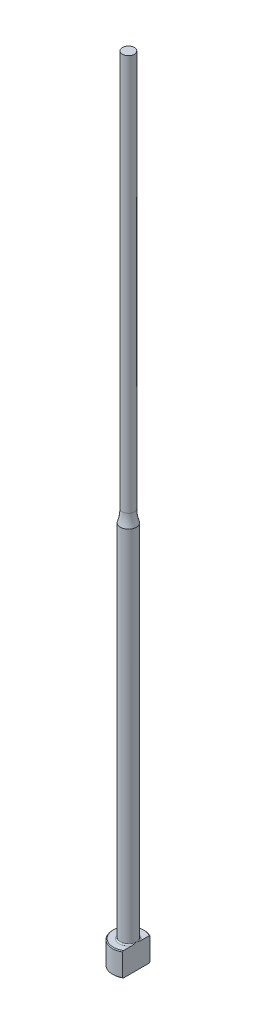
ISO-10303-21;
HEADER;
FILE_DESCRIPTION(('STEP AP214'),'2;1');
FILE_NAME('part.step','',(''),(''),'','','');
FILE_SCHEMA(('AUTOMOTIVE_DESIGN { 1 0 10303 214 1 1 1 1 }'));
ENDSEC;
DATA;
#1=APPLICATION_CONTEXT('core data for automotive mechanical design processes');
#2=APPLICATION_PROTOCOL_DEFINITION('international standard','automotive_design',2000,#1);
#3=PRODUCT_CONTEXT('',#1,'mechanical');
#4=PRODUCT('Part','Part','',(#3));
#5=PRODUCT_RELATED_PRODUCT_CATEGORY('part','',(#4));
#6=PRODUCT_DEFINITION_FORMATION('','',#4);
#7=PRODUCT_DEFINITION_CONTEXT('part definition',#1,'design');
#8=PRODUCT_DEFINITION('design','',#6,#7);
#9=PRODUCT_DEFINITION_SHAPE('','',#8);
#10=(LENGTH_UNIT() NAMED_UNIT(*) SI_UNIT(.MILLI.,.METRE.));
#11=(NAMED_UNIT(*) PLANE_ANGLE_UNIT() SI_UNIT($,.RADIAN.));
#12=(NAMED_UNIT(*) SI_UNIT($,.STERADIAN.) SOLID_ANGLE_UNIT());
#13=UNCERTAINTY_MEASURE_WITH_UNIT(LENGTH_MEASURE(1.E-05),#10,'distance_accuracy_value','');
#14=(GEOMETRIC_REPRESENTATION_CONTEXT(3) GLOBAL_UNCERTAINTY_ASSIGNED_CONTEXT((#13)) GLOBAL_UNIT_ASSIGNED_CONTEXT((#10,
#11,#12)) REPRESENTATION_CONTEXT('',''));
#15=CARTESIAN_POINT('',(0.,0.,0.));
#16=DIRECTION('',(0.,0.,1.));
#17=DIRECTION('',(1.,0.,0.));
#18=AXIS2_PLACEMENT_3D('',#15,#16,#17);
#19=CARTESIAN_POINT('',(-3.99999999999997,6.,0.));
#20=DIRECTION('',(0.,1.,0.));
#21=DIRECTION('',(0.,0.,1.));
#22=AXIS2_PLACEMENT_3D('',#19,#20,#21);
#23=PLANE('',#22);
#24=CARTESIAN_POINT('',(0.,6.,0.));
#25=DIRECTION('',(0.,1.,0.));
#26=DIRECTION('',(0.,0.,1.));
#27=AXIS2_PLACEMENT_3D('',#24,#25,#26);
#28=CIRCLE('',#27,3.80000000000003);
#29=CARTESIAN_POINT('',(1.99999999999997,6.,-3.23109888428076));
#30=VERTEX_POINT('',#29);
#31=CARTESIAN_POINT('',(1.99999999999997,6.,3.23109888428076));
#32=VERTEX_POINT('',#31);
#33=EDGE_CURVE('E187',#30,#32,#28,.T.);
#34=ORIENTED_EDGE('',*,*,#33,.T.);
#35=DIRECTION('',(0.,0.,-1.));
#36=VECTOR('',#35,1.);
#37=CARTESIAN_POINT('',(1.99999999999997,6.,0.));
#38=LINE('',#37,#36);
#39=CARTESIAN_POINT('',(1.99999999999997,5.99999999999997,1.13578166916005));
#40=VERTEX_POINT('',#39);
#41=EDGE_CURVE('E57',#32,#40,#38,.T.);
#42=ORIENTED_EDGE('',*,*,#41,.T.);
#43=CARTESIAN_POINT('',(0.,6.,0.));
#44=DIRECTION('',(0.,1.,0.));
#45=DIRECTION('',(0.,0.,1.));
#46=AXIS2_PLACEMENT_3D('',#43,#44,#45);
#47=CIRCLE('',#46,2.29999999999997);
#48=CARTESIAN_POINT('',(1.99999999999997,5.99999999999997,-1.13578166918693));
#49=VERTEX_POINT('',#48);
#50=EDGE_CURVE('E108',#40,#49,#47,.F.);
#51=ORIENTED_EDGE('',*,*,#50,.T.);
#52=EDGE_CURVE('E137',#49,#30,#38,.T.);
#53=ORIENTED_EDGE('',*,*,#52,.T.);
#54=EDGE_LOOP('',(#34,#42,#51,#53));
#55=FACE_BOUND('',#54,.T.);
#56=ADVANCED_FACE('F32',(#55),#23,.T.);
#57=CARTESIAN_POINT('',(0.,259.958771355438,0.));
#58=DIRECTION('',(0.,1.,0.));
#59=DIRECTION('',(0.,0.,1.));
#60=AXIS2_PLACEMENT_3D('',#57,#58,#59);
#61=CYLINDRICAL_SURFACE('',#60,3.99999999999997);
#62=CARTESIAN_POINT('',(0.,5.80000000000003,0.));
#63=DIRECTION('',(0.,1.,0.));
#64=DIRECTION('',(0.,0.,1.));
#65=AXIS2_PLACEMENT_3D('',#62,#63,#64);
#66=CIRCLE('',#65,3.99999999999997);
#67=CARTESIAN_POINT('',(1.99999999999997,5.80000000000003,3.46410161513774));
#68=VERTEX_POINT('',#67);
#69=CARTESIAN_POINT('',(1.99999999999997,5.80000000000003,-3.46410161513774));
#70=VERTEX_POINT('',#69);
#71=EDGE_CURVE('E105',#68,#70,#66,.F.);
#72=ORIENTED_EDGE('',*,*,#71,.T.);
#73=DIRECTION('',(0.,-1.,0.));
#74=VECTOR('',#73,1.);
#75=CARTESIAN_POINT('',(1.99999999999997,200.,-3.46410161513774));
#76=LINE('',#75,#74);
#77=CARTESIAN_POINT('',(1.99999999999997,0.199999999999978,-3.46410161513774));
#78=VERTEX_POINT('',#77);
#79=EDGE_CURVE('E193',#70,#78,#76,.T.);
#80=ORIENTED_EDGE('',*,*,#79,.T.);
#81=CARTESIAN_POINT('',(0.,0.199999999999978,0.));
#82=DIRECTION('',(0.,-1.,0.));
#83=DIRECTION('',(0.,0.,-1.));
#84=AXIS2_PLACEMENT_3D('',#81,#82,#83);
#85=CIRCLE('',#84,3.99999999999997);
#86=CARTESIAN_POINT('',(1.99999999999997,0.199999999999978,3.46410161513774));
#87=VERTEX_POINT('',#86);
#88=EDGE_CURVE('E100',#78,#87,#85,.F.);
#89=ORIENTED_EDGE('',*,*,#88,.T.);
#90=DIRECTION('',(0.,-1.,0.));
#91=VECTOR('',#90,1.);
#92=CARTESIAN_POINT('',(1.99999999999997,200.,3.46410161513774));
#93=LINE('',#92,#91);
#94=EDGE_CURVE('E93',#68,#87,#93,.T.);
#95=ORIENTED_EDGE('',*,*,#94,.F.);
#96=EDGE_LOOP('',(#72,#80,#89,#95));
#97=FACE_BOUND('',#96,.T.);
#98=ADVANCED_FACE('F158',(#97),#61,.T.);
#99=CARTESIAN_POINT('',(0.,0.,0.));
#100=DIRECTION('',(0.,-1.,0.));
#101=DIRECTION('',(0.,0.,-1.));
#102=AXIS2_PLACEMENT_3D('',#99,#100,#101);
#103=PLANE('',#102);
#104=CARTESIAN_POINT('',(0.,0.,0.));
#105=DIRECTION('',(0.,-1.,0.));
#106=DIRECTION('',(0.,0.,-1.));
#107=AXIS2_PLACEMENT_3D('',#104,#105,#106);
#108=CIRCLE('',#107,3.79999999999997);
#109=CARTESIAN_POINT('',(1.99999999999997,0.,3.23109888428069));
#110=VERTEX_POINT('',#109);
#111=CARTESIAN_POINT('',(1.99999999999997,0.,-3.23109888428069));
#112=VERTEX_POINT('',#111);
#113=EDGE_CURVE('E98',#110,#112,#108,.T.);
#114=ORIENTED_EDGE('',*,*,#113,.T.);
#115=DIRECTION('',(0.,0.,1.));
#116=VECTOR('',#115,1.);
#117=CARTESIAN_POINT('',(1.99999999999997,0.,3.46410161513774));
#118=LINE('',#117,#116);
#119=EDGE_CURVE('E83',#112,#110,#118,.T.);
#120=ORIENTED_EDGE('',*,*,#119,.T.);
#121=EDGE_LOOP('',(#114,#120));
#122=FACE_BOUND('',#121,.T.);
#123=ADVANCED_FACE('F103',(#122),#103,.T.);
#124=CARTESIAN_POINT('',(0.,6.00000000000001,0.));
#125=DIRECTION('',(0.,-1.,0.));
#126=DIRECTION('',(0.,0.,-1.));
#127=AXIS2_PLACEMENT_3D('',#124,#125,#126);
#128=CONICAL_SURFACE('',#127,3.80000000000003,0.785398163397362);
#129=ORIENTED_EDGE('',*,*,#71,.F.);
#130=CARTESIAN_POINT('',(1.99999999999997,1.91904532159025,7.62295524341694));
#131=CARTESIAN_POINT('',(1.99999999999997,2.08611243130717,7.4502239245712));
#132=CARTESIAN_POINT('',(1.99999999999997,2.25300024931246,7.27731861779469));
#133=CARTESIAN_POINT('',(1.99999999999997,2.58631125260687,6.93105655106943));
#134=CARTESIAN_POINT('',(1.99999999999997,2.75273443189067,6.75769978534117));
#135=CARTESIAN_POINT('',(1.99999999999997,3.08509080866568,6.41034692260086));
#136=CARTESIAN_POINT('',(1.99999999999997,3.25102371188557,6.23635054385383));
#137=CARTESIAN_POINT('',(1.99999999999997,3.58215598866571,5.88766284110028));
#138=CARTESIAN_POINT('',(1.99999999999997,3.74735536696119,5.71297152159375));
#139=CARTESIAN_POINT('',(1.99999999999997,4.0735385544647,5.36616839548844));
#140=CARTESIAN_POINT('',(1.99999999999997,4.23454099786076,5.19407412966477));
#141=CARTESIAN_POINT('',(1.99999999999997,4.55534102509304,4.84876663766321));
#142=CARTESIAN_POINT('',(1.99999999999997,4.71513861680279,4.67555341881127));
#143=CARTESIAN_POINT('',(1.99999999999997,5.0330618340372,4.32766569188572));
#144=CARTESIAN_POINT('',(1.99999999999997,5.191187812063,4.15299150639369));
#145=CARTESIAN_POINT('',(1.99999999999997,5.50513944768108,3.80159134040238));
#146=CARTESIAN_POINT('',(1.99999999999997,5.66096519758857,3.62486544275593));
#147=CARTESIAN_POINT('',(1.99999999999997,5.90974646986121,3.33722425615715));
#148=CARTESIAN_POINT('',(1.99999999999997,6.00376148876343,3.22722645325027));
#149=CARTESIAN_POINT('',(1.99999999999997,6.19011825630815,3.00579987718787));
#150=CARTESIAN_POINT('',(1.99999999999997,6.28245983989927,2.89437096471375));
#151=CARTESIAN_POINT('',(1.99999999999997,6.46586188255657,2.66849662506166));
#152=CARTESIAN_POINT('',(1.99999999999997,6.55689849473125,2.55403176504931));
#153=CARTESIAN_POINT('',(1.99999999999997,6.73578809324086,2.32266819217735));
#154=CARTESIAN_POINT('',(1.99999999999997,6.82364184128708,2.20577007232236));
#155=CARTESIAN_POINT('',(1.99999999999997,6.99612756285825,1.96688707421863));
#156=CARTESIAN_POINT('',(1.99999999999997,7.08069035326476,1.84485190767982));
#157=CARTESIAN_POINT('',(1.99999999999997,7.2430026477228,1.59599329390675));
#158=CARTESIAN_POINT('',(1.99999999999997,7.32074277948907,1.46916359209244));
#159=CARTESIAN_POINT('',(1.99999999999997,7.42869763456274,1.27510066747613));
#160=CARTESIAN_POINT('',(1.99999999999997,7.46305374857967,1.21018943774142));
#161=CARTESIAN_POINT('',(1.99999999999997,7.52837146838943,1.07868835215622));
#162=CARTESIAN_POINT('',(1.99999999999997,7.55933245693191,1.01209819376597));
#163=CARTESIAN_POINT('',(1.99999999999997,7.64566860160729,0.8098943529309));
#164=CARTESIAN_POINT('',(1.99999999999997,7.69478214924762,0.671360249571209));
#165=CARTESIAN_POINT('',(1.99999999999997,7.74794829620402,0.463657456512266));
#166=CARTESIAN_POINT('',(1.99999999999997,7.76205065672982,0.397033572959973));
#167=CARTESIAN_POINT('',(1.99999999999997,7.78390371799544,0.26272845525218));
#168=CARTESIAN_POINT('',(1.99999999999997,7.79165498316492,0.19504731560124));
#169=CARTESIAN_POINT('',(1.99999999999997,7.80025690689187,0.0594528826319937));
#170=CARTESIAN_POINT('',(1.99999999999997,7.80112894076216,-0.00845903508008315));
#171=CARTESIAN_POINT('',(1.99999999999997,7.79596585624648,-0.144020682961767));
#172=CARTESIAN_POINT('',(1.99999999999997,7.78993016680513,-0.211670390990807));
#173=CARTESIAN_POINT('',(1.99999999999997,7.77145363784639,-0.345483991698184));
#174=CARTESIAN_POINT('',(1.99999999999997,7.7590677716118,-0.411655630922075));
#175=CARTESIAN_POINT('',(1.99999999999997,7.72866360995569,-0.542678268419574));
#176=CARTESIAN_POINT('',(1.99999999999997,7.71064463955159,-0.607529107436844));
#177=CARTESIAN_POINT('',(1.99999999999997,7.669729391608,-0.736064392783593));
#178=CARTESIAN_POINT('',(1.99999999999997,7.64680564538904,-0.79973998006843));
#179=CARTESIAN_POINT('',(1.99999999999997,7.59700147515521,-0.925489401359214));
#180=CARTESIAN_POINT('',(1.99999999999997,7.57012185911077,-0.98756355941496));
#181=CARTESIAN_POINT('',(1.99999999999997,7.48443518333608,-1.17209020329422));
#182=CARTESIAN_POINT('',(1.99999999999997,7.42077407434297,-1.29228210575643));
#183=CARTESIAN_POINT('',(1.99999999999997,7.28502644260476,-1.52785770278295));
#184=CARTESIAN_POINT('',(1.99999999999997,7.21292931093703,-1.6432350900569));
#185=CARTESIAN_POINT('',(1.99999999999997,7.06281517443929,-1.8706938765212));
#186=CARTESIAN_POINT('',(1.99999999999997,6.98477595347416,-1.98276048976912));
#187=CARTESIAN_POINT('',(1.99999999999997,6.8248197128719,-2.20397837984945));
#188=CARTESIAN_POINT('',(1.99999999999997,6.74290465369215,-2.31313108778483));
#189=CARTESIAN_POINT('',(1.99999999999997,6.57517222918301,-2.5306854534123));
#190=CARTESIAN_POINT('',(1.99999999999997,6.4893176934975,-2.63905831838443));
#191=CARTESIAN_POINT('',(1.99999999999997,6.31548151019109,-2.85409686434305));
#192=CARTESIAN_POINT('',(1.99999999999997,6.22749963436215,-2.96076236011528));
#193=CARTESIAN_POINT('',(1.99999999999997,6.05015030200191,-3.17249211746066));
#194=CARTESIAN_POINT('',(1.99999999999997,5.96078672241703,-3.27755963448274));
#195=CARTESIAN_POINT('',(1.99999999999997,5.78082366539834,-3.48663191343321));
#196=CARTESIAN_POINT('',(1.99999999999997,5.69022416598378,-3.59063665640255));
#197=CARTESIAN_POINT('',(1.99999999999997,5.44796733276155,-3.86612439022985));
#198=CARTESIAN_POINT('',(1.99999999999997,5.29545972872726,-4.03685912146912));
#199=CARTESIAN_POINT('',(1.99999999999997,4.98858070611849,-4.37664803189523));
#200=CARTESIAN_POINT('',(1.99999999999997,4.83420923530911,-4.54570216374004));
#201=CARTESIAN_POINT('',(1.99999999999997,4.52396102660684,-4.88271638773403));
#202=CARTESIAN_POINT('',(1.99999999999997,4.36808300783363,-5.05067529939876));
#203=CARTESIAN_POINT('',(1.99999999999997,4.05530513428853,-5.38563883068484));
#204=CARTESIAN_POINT('',(1.99999999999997,3.8984052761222,-5.55264344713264));
#205=CARTESIAN_POINT('',(1.99999999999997,3.59029018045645,-5.87905385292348));
#206=CARTESIAN_POINT('',(1.99999999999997,3.43910664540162,-6.03848959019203));
#207=CARTESIAN_POINT('',(1.99999999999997,3.13616436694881,-6.35681456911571));
#208=CARTESIAN_POINT('',(1.99999999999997,2.98440562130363,-6.5157038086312));
#209=CARTESIAN_POINT('',(1.99999999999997,2.68059501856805,-6.83286192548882));
#210=CARTESIAN_POINT('',(1.99999999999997,2.52854367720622,-6.99113129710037));
#211=CARTESIAN_POINT('',(1.99999999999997,2.22406035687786,-7.30730102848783));
#212=CARTESIAN_POINT('',(1.99999999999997,2.07162838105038,-7.46520139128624));
#213=CARTESIAN_POINT('',(1.99999999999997,1.91904532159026,-7.62295524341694));
#214=B_SPLINE_CURVE_WITH_KNOTS('',3,(#130,#131,#132,#133,#134,#135,#136,#137,#138,#139,#140,
#141,#142,#143,#144,#145,#146,#147,#148,#149,#150,#151,#152,#153,#154,#155,#156,#157,#158,#159,
#160,#161,#162,#163,#164,#165,#166,#167,#168,#169,#170,#171,#172,#173,#174,#175,#176,#177,#178,
#179,#180,#181,#182,#183,#184,#185,#186,#187,#188,#189,#190,#191,#192,#193,#194,#195,#196,#197,
#198,#199,#200,#201,#202,#203,#204,#205,#206,#207,#208,#209,#210,#211,#212,#213),.UNSPECIFIED.,
.F.,.F.,(4,2,2,2,2,2,2,2,2,2,2,2,2,2,2,2,2,2,2,2,2,2,2,2,2,2,2,2,2,2,2,2,2,2,2,2,2,2,2,2,2,4),
(0.,0.720921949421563,1.4418531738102,2.16315326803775,2.8844486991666,3.59144103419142,
4.29842874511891,5.00526427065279,5.7120713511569,6.14616174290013,6.58029471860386,
7.01901494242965,7.45762947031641,7.90290456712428,8.34878206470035,8.56901415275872,
8.78928621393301,9.228144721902,9.43219512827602,9.63622739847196,9.83962544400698,
10.0430403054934,10.244723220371,10.4464303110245,10.6492980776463,10.8521244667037,
11.2595582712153,11.6675100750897,12.0770700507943,12.4864250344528,12.9011677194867,
13.3159550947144,13.7297367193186,14.1435257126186,14.8302935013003,15.5170805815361,
16.2045145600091,16.891950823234,17.5511045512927,18.2102608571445,18.8686819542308,
19.5270976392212),.UNSPECIFIED.);
#215=EDGE_CURVE('E136',#68,#32,#214,.T.);
#216=ORIENTED_EDGE('',*,*,#215,.T.);
#217=ORIENTED_EDGE('',*,*,#33,.F.);
#218=EDGE_CURVE('E128',#30,#70,#214,.T.);
#219=ORIENTED_EDGE('',*,*,#218,.T.);
#220=EDGE_LOOP('',(#129,#216,#217,#219));
#221=FACE_BOUND('',#220,.T.);
#222=ADVANCED_FACE('F144',(#221),#128,.T.);
#223=CARTESIAN_POINT('',(0.,0.199999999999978,0.));
#224=DIRECTION('',(0.,1.,0.));
#225=DIRECTION('',(0.,0.,1.));
#226=AXIS2_PLACEMENT_3D('',#223,#224,#225);
#227=CONICAL_SURFACE('',#226,3.99999999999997,0.7853981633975);
#228=ORIENTED_EDGE('',*,*,#88,.F.);
#229=CARTESIAN_POINT('',(1.99999999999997,4.08095467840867,-7.62295524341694));
#230=CARTESIAN_POINT('',(1.99999999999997,3.91388756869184,-7.45022392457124));
#231=CARTESIAN_POINT('',(1.99999999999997,3.74699975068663,-7.27731861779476));
#232=CARTESIAN_POINT('',(1.99999999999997,3.41368874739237,-6.93105655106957));
#233=CARTESIAN_POINT('',(1.99999999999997,3.24726556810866,-6.75769978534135));
#234=CARTESIAN_POINT('',(1.99999999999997,2.91490919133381,-6.4103469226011));
#235=CARTESIAN_POINT('',(1.99999999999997,2.74897628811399,-6.23635054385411));
#236=CARTESIAN_POINT('',(1.99999999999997,2.41784401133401,-5.88766284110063));
#237=CARTESIAN_POINT('',(1.99999999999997,2.25264463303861,-5.71297152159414));
#238=CARTESIAN_POINT('',(1.99999999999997,1.92646144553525,-5.3661683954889));
#239=CARTESIAN_POINT('',(1.99999999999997,1.76545900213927,-5.19407412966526));
#240=CARTESIAN_POINT('',(1.99999999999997,1.44465897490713,-4.84876663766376));
#241=CARTESIAN_POINT('',(1.99999999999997,1.28486138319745,-4.67555341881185));
#242=CARTESIAN_POINT('',(1.99999999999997,0.966938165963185,-4.32766569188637));
#243=CARTESIAN_POINT('',(1.99999999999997,0.80881218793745,-4.15299150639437));
#244=CARTESIAN_POINT('',(1.99999999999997,0.494860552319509,-3.80159134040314));
#245=CARTESIAN_POINT('',(1.99999999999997,0.339034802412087,-3.62486544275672));
#246=CARTESIAN_POINT('',(1.99999999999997,0.0902535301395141,-3.33722425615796));
#247=CARTESIAN_POINT('',(1.99999999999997,-0.0037614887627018,-3.22722645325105));
#248=CARTESIAN_POINT('',(1.99999999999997,-0.190118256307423,-3.0057998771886));
#249=CARTESIAN_POINT('',(1.99999999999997,-0.282459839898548,-2.89437096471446));
#250=CARTESIAN_POINT('',(1.99999999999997,-0.465861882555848,-2.66849662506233));
#251=CARTESIAN_POINT('',(1.99999999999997,-0.556898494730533,-2.55403176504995));
#252=CARTESIAN_POINT('',(1.99999999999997,-0.735788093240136,-2.32266819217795));
#253=CARTESIAN_POINT('',(1.99999999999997,-0.823641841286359,-2.20577007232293));
#254=CARTESIAN_POINT('',(1.99999999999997,-0.996127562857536,-1.96688707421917));
#255=CARTESIAN_POINT('',(1.99999999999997,-1.08069035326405,-1.84485190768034));
#256=CARTESIAN_POINT('',(1.99999999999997,-1.2430026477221,-1.59599329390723));
#257=CARTESIAN_POINT('',(1.99999999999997,-1.32074277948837,-1.4691635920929));
#258=CARTESIAN_POINT('',(1.99999999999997,-1.42869763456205,-1.27510066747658));
#259=CARTESIAN_POINT('',(1.99999999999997,-1.46305374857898,-1.21018943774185));
#260=CARTESIAN_POINT('',(1.99999999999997,-1.52837146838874,-1.07868835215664));
#261=CARTESIAN_POINT('',(1.99999999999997,-1.55933245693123,-1.01209819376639));
#262=CARTESIAN_POINT('',(1.99999999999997,-1.64566860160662,-0.809894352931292));
#263=CARTESIAN_POINT('',(1.99999999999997,-1.69478214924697,-0.671360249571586));
#264=CARTESIAN_POINT('',(1.99999999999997,-1.74794829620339,-0.463657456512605));
#265=CARTESIAN_POINT('',(1.99999999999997,-1.76205065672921,-0.397033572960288));
#266=CARTESIAN_POINT('',(1.99999999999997,-1.78390371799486,-0.262728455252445));
#267=CARTESIAN_POINT('',(1.99999999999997,-1.79165498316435,-0.19504731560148));
#268=CARTESIAN_POINT('',(1.99999999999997,-1.80025690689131,-0.059452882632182));
#269=CARTESIAN_POINT('',(1.99999999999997,-1.8011289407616,0.00845903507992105));
#270=CARTESIAN_POINT('',(1.99999999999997,-1.79596585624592,0.144020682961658));
#271=CARTESIAN_POINT('',(1.99999999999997,-1.78993016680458,0.211670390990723));
#272=CARTESIAN_POINT('',(1.99999999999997,-1.77145363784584,0.345483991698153));
#273=CARTESIAN_POINT('',(1.99999999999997,-1.75906777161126,0.411655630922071));
#274=CARTESIAN_POINT('',(1.99999999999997,-1.72866360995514,0.542678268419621));
#275=CARTESIAN_POINT('',(1.99999999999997,-1.71064463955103,0.607529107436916));
#276=CARTESIAN_POINT('',(1.99999999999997,-1.66972939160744,0.736064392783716));
#277=CARTESIAN_POINT('',(1.99999999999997,-1.64680564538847,0.799739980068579));
#278=CARTESIAN_POINT('',(1.99999999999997,-1.59700147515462,0.925489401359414));
#279=CARTESIAN_POINT('',(1.99999999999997,-1.57012185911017,0.987563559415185));
#280=CARTESIAN_POINT('',(1.99999999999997,-1.48443518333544,1.17209020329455));
#281=CARTESIAN_POINT('',(1.99999999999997,-1.4207740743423,1.29228210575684));
#282=CARTESIAN_POINT('',(1.99999999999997,-1.28502644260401,1.52785770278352));
#283=CARTESIAN_POINT('',(1.99999999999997,-1.21292931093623,1.64323509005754));
#284=CARTESIAN_POINT('',(1.99999999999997,-1.0628151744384,1.87069387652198));
#285=CARTESIAN_POINT('',(1.99999999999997,-0.984775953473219,1.98276048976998));
#286=CARTESIAN_POINT('',(1.99999999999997,-0.82481971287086,2.20397837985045));
#287=CARTESIAN_POINT('',(1.99999999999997,-0.742904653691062,2.31313108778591));
#288=CARTESIAN_POINT('',(1.99999999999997,-0.575172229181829,2.53068545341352));
#289=CARTESIAN_POINT('',(1.99999999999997,-0.489317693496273,2.63905831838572));
#290=CARTESIAN_POINT('',(1.99999999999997,-0.315481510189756,2.85409686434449));
#291=CARTESIAN_POINT('',(1.99999999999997,-0.227499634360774,2.9607623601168));
#292=CARTESIAN_POINT('',(1.99999999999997,-0.0501503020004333,3.17249211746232));
#293=CARTESIAN_POINT('',(1.99999999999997,0.0392132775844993,3.27755963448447));
#294=CARTESIAN_POINT('',(1.99999999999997,0.219176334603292,3.48663191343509));
#295=CARTESIAN_POINT('',(1.99999999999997,0.309775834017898,3.59063665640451));
#296=CARTESIAN_POINT('',(1.99999999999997,0.552032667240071,3.86612439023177));
#297=CARTESIAN_POINT('',(1.99999999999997,0.704540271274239,4.03685912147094));
#298=CARTESIAN_POINT('',(1.99999999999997,1.01141929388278,4.37664803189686));
#299=CARTESIAN_POINT('',(1.99999999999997,1.16579076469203,4.54570216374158));
#300=CARTESIAN_POINT('',(1.99999999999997,1.47603897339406,4.88271638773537));
#301=CARTESIAN_POINT('',(1.99999999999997,1.63191699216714,5.05067529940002));
#302=CARTESIAN_POINT('',(1.99999999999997,1.94469486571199,5.38563883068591));
#303=CARTESIAN_POINT('',(1.99999999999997,2.10159472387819,5.55264344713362));
#304=CARTESIAN_POINT('',(1.99999999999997,2.40970981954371,5.87905385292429));
#305=CARTESIAN_POINT('',(1.99999999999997,2.56089335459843,6.03848959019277));
#306=CARTESIAN_POINT('',(1.99999999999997,2.86383563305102,6.3568145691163));
#307=CARTESIAN_POINT('',(1.99999999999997,3.01559437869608,6.51570380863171));
#308=CARTESIAN_POINT('',(1.99999999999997,3.31940498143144,6.83286192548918));
#309=CARTESIAN_POINT('',(1.99999999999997,3.47145632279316,6.99113129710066));
#310=CARTESIAN_POINT('',(1.99999999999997,3.77593964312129,7.30730102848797));
#311=CARTESIAN_POINT('',(1.99999999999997,3.92837161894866,7.46520139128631));
#312=CARTESIAN_POINT('',(1.99999999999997,4.08095467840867,7.62295524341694));
#313=B_SPLINE_CURVE_WITH_KNOTS('',3,(#229,#230,#231,#232,#233,#234,#235,#236,#237,#238,#239,
#240,#241,#242,#243,#244,#245,#246,#247,#248,#249,#250,#251,#252,#253,#254,#255,#256,#257,#258,
#259,#260,#261,#262,#263,#264,#265,#266,#267,#268,#269,#270,#271,#272,#273,#274,#275,#276,#277,
#278,#279,#280,#281,#282,#283,#284,#285,#286,#287,#288,#289,#290,#291,#292,#293,#294,#295,#296,
#297,#298,#299,#300,#301,#302,#303,#304,#305,#306,#307,#308,#309,#310,#311,#312),.UNSPECIFIED.,
.F.,.F.,(4,2,2,2,2,2,2,2,2,2,2,2,2,2,2,2,2,2,2,2,2,2,2,2,2,2,2,2,2,2,2,2,2,2,2,2,2,2,2,2,2,4),
(0.,0.720921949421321,1.44185317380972,2.16315326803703,2.88444869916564,3.59144103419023,
4.29842874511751,5.00526427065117,5.71207135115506,6.14616174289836,6.58029471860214,
7.01901494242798,7.45762947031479,7.90290456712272,8.34878206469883,8.56901415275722,
8.78928621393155,9.22814472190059,9.43219512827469,9.63622739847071,9.8396254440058,
10.0430403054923,10.24472322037,10.4464303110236,10.6492980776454,10.8521244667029,
11.2595582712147,11.6675100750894,12.0770700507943,12.4864250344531,12.9011677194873,
13.3159550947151,13.7297367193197,14.1435257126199,14.8302935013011,15.5170805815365,
16.204514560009,16.8919508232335,17.5511045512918,18.2102608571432,18.8686819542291,
19.5270976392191),.UNSPECIFIED.);
#314=EDGE_CURVE('E86',#78,#112,#313,.T.);
#315=ORIENTED_EDGE('',*,*,#314,.T.);
#316=ORIENTED_EDGE('',*,*,#113,.F.);
#317=EDGE_CURVE('E89',#110,#87,#313,.T.);
#318=ORIENTED_EDGE('',*,*,#317,.T.);
#319=EDGE_LOOP('',(#228,#315,#316,#318));
#320=FACE_BOUND('',#319,.T.);
#321=ADVANCED_FACE('F97',(#320),#227,.T.);
#322=CARTESIAN_POINT('',(0.,6.29999999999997,0.));
#323=DIRECTION('',(0.,1.,0.));
#324=DIRECTION('',(0.,0.,1.));
#325=AXIS2_PLACEMENT_3D('',#322,#323,#324);
#326=TOROIDAL_SURFACE('',#325,2.29999999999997,0.3);
#327=CARTESIAN_POINT('',(1.99999999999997,6.29999999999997,0.));
#328=CARTESIAN_POINT('',(1.99999999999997,6.30000062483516,-7.91120119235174E-11));
#329=CARTESIAN_POINT('',(1.99999999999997,6.3000012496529,-1.38466953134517E-07));
#330=CARTESIAN_POINT('',(1.99999999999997,6.3000024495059,-5.72507056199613E-07));
#331=CARTESIAN_POINT('',(1.99999999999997,6.30000302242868,-8.72848936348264E-07));
#332=CARTESIAN_POINT('',(1.99999999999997,6.30000416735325,-1.59335938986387E-06));
#333=CARTESIAN_POINT('',(1.99999999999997,6.30000473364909,-2.02244692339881E-06));
#334=CARTESIAN_POINT('',(1.99999999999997,6.30000579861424,-2.94494844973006E-06));
#335=CARTESIAN_POINT('',(1.99999999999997,6.30000629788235,-3.4377030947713E-06));
#336=CARTESIAN_POINT('',(1.99999999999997,6.30000798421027,-5.21460072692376E-06));
#337=CARTESIAN_POINT('',(1.99999999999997,6.30000908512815,-6.58180911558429E-06));
#338=CARTESIAN_POINT('',(1.99999999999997,6.30001103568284,-9.3977532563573E-06));
#339=CARTESIAN_POINT('',(1.99999999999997,6.30001189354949,-1.08411101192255E-05));
#340=CARTESIAN_POINT('',(1.99999999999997,6.30001514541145,-1.65122775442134E-05));
#341=CARTESIAN_POINT('',(1.99999999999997,6.30001737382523,-2.08398783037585E-05));
#342=CARTESIAN_POINT('',(1.99999999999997,6.30002099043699,-2.93440763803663E-05));
#343=CARTESIAN_POINT('',(1.99999999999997,6.30002243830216,-3.34960297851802E-05));
#344=CARTESIAN_POINT('',(1.99999999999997,6.30002863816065,-5.12890573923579E-05));
#345=CARTESIAN_POINT('',(1.99999999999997,6.30003337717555,-6.49250938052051E-05));
#346=CARTESIAN_POINT('',(1.99999999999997,6.30004093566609,-9.03829827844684E-05));
#347=CARTESIAN_POINT('',(1.99999999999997,6.30004394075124,-0.000102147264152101));
#348=CARTESIAN_POINT('',(1.99999999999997,6.30006787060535,-0.000188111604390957));
#349=CARTESIAN_POINT('',(1.99999999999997,6.3000985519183,-0.000259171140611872));
#350=CARTESIAN_POINT('',(1.99999999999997,6.30021378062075,-0.00053614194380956));
#351=CARTESIAN_POINT('',(1.99999999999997,6.3002910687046,-0.000744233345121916));
#352=CARTESIAN_POINT('',(1.99999999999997,6.30059644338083,-0.00155446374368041));
#353=CARTESIAN_POINT('',(1.99999999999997,6.30083214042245,-0.00215436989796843));
#354=CARTESIAN_POINT('',(1.99999999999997,6.30179425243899,-0.00461477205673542));
#355=CARTESIAN_POINT('',(1.99999999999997,6.30251207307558,-0.00647773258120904));
#356=CARTESIAN_POINT('',(1.99999999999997,6.31311632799,-0.0339840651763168));
#357=CARTESIAN_POINT('',(1.99999999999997,6.32306890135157,-0.0596088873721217));
#358=CARTESIAN_POINT('',(1.99999999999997,6.34248629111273,-0.109946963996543));
#359=CARTESIAN_POINT('',(1.99999999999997,6.35195547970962,-0.134658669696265));
#360=CARTESIAN_POINT('',(1.99999999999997,6.37186796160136,-0.18704653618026));
#361=CARTESIAN_POINT('',(1.99999999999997,6.38229466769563,-0.214729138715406));
#362=CARTESIAN_POINT('',(1.99999999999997,6.40297705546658,-0.270480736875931));
#363=CARTESIAN_POINT('',(1.99999999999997,6.41322989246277,-0.298550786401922));
#364=CARTESIAN_POINT('',(1.99999999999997,6.43806738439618,-0.36800773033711));
#365=CARTESIAN_POINT('',(1.99999999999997,6.45243182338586,-0.409474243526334));
#366=CARTESIAN_POINT('',(1.99999999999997,6.47965482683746,-0.491807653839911));
#367=CARTESIAN_POINT('',(1.99999999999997,6.49254110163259,-0.532665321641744));
#368=CARTESIAN_POINT('',(1.99999999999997,6.51851192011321,-0.620554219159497));
#369=CARTESIAN_POINT('',(1.99999999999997,6.53137383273,-0.667652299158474));
#370=CARTESIAN_POINT('',(1.99999999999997,6.55459547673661,-0.762854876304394));
#371=CARTESIAN_POINT('',(1.99999999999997,6.5649353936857,-0.810964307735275));
#372=CARTESIAN_POINT('',(1.99999999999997,6.58270957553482,-0.910933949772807));
#373=CARTESIAN_POINT('',(1.99999999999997,6.58991426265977,-0.962836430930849));
#374=CARTESIAN_POINT('',(1.99999999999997,6.59906919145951,-1.06698400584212));
#375=CARTESIAN_POINT('',(1.99999999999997,6.60103790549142,-1.1192272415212));
#376=CARTESIAN_POINT('',(1.99999999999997,6.59819318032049,-1.21399009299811));
#377=CARTESIAN_POINT('',(1.99999999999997,6.59455548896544,-1.2565387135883));
#378=CARTESIAN_POINT('',(1.99999999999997,6.58116512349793,-1.34017723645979));
#379=CARTESIAN_POINT('',(1.99999999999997,6.57150205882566,-1.38127935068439));
#380=CARTESIAN_POINT('',(1.99999999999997,6.55087659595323,-1.44109771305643));
#381=CARTESIAN_POINT('',(1.99999999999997,6.5429124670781,-1.46084510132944));
#382=CARTESIAN_POINT('',(1.99999999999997,6.52453399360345,-1.49924523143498));
#383=CARTESIAN_POINT('',(1.99999999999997,6.51411538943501,-1.51789599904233));
#384=CARTESIAN_POINT('',(1.99999999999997,6.49255299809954,-1.55022658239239));
#385=CARTESIAN_POINT('',(1.99999999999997,6.48185951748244,-1.56420357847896));
#386=CARTESIAN_POINT('',(1.99999999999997,6.45839348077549,-1.5902875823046));
#387=CARTESIAN_POINT('',(1.99999999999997,6.445625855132,-1.60239889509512));
#388=CARTESIAN_POINT('',(1.99999999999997,6.4218327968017,-1.62093425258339));
#389=CARTESIAN_POINT('',(1.99999999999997,6.41131183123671,-1.6280029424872));
#390=CARTESIAN_POINT('',(1.99999999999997,6.38926242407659,-1.64036132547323));
#391=CARTESIAN_POINT('',(1.99999999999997,6.37773458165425,-1.64565206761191));
#392=CARTESIAN_POINT('',(1.99999999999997,6.35379760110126,-1.65410966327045));
#393=CARTESIAN_POINT('',(1.99999999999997,6.34138166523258,-1.65725762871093));
#394=CARTESIAN_POINT('',(1.99999999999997,6.31617371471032,-1.66106000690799));
#395=CARTESIAN_POINT('',(1.99999999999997,6.3033820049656,-1.66171638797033));
#396=CARTESIAN_POINT('',(1.99999999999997,6.27959278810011,-1.66055848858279));
#397=CARTESIAN_POINT('',(1.99999999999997,6.26857876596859,-1.6590551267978));
#398=CARTESIAN_POINT('',(1.99999999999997,6.24695777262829,-1.65423593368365));
#399=CARTESIAN_POINT('',(1.99999999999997,6.23635086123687,-1.65091983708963));
#400=CARTESIAN_POINT('',(1.99999999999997,6.21566894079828,-1.64264699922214));
#401=CARTESIAN_POINT('',(1.99999999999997,6.20560117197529,-1.63767239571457));
#402=CARTESIAN_POINT('',(1.99999999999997,6.18626855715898,-1.626364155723));
#403=CARTESIAN_POINT('',(1.99999999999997,6.17700400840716,-1.62003001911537));
#404=CARTESIAN_POINT('',(1.99999999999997,6.15429988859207,-1.60233802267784));
#405=CARTESIAN_POINT('',(1.99999999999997,6.14148777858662,-1.59017362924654));
#406=CARTESIAN_POINT('',(1.99999999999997,6.11794267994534,-1.56396532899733));
#407=CARTESIAN_POINT('',(1.99999999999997,6.10721625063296,-1.54991572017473));
#408=CARTESIAN_POINT('',(1.99999999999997,6.08234423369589,-1.51253200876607));
#409=CARTESIAN_POINT('',(1.99999999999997,6.06952968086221,-1.48831711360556));
#410=CARTESIAN_POINT('',(1.99999999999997,6.04773953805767,-1.43832020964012));
#411=CARTESIAN_POINT('',(1.99999999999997,6.03876197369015,-1.41253901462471));
#412=CARTESIAN_POINT('',(1.99999999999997,6.01850750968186,-1.3410181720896));
#413=CARTESIAN_POINT('',(1.99999999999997,6.01031623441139,-1.29441496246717));
#414=CARTESIAN_POINT('',(1.99999999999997,6.00061264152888,-1.19993212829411));
#415=CARTESIAN_POINT('',(1.99999999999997,5.99920833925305,-1.15204398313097));
#416=CARTESIAN_POINT('',(1.99999999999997,6.001930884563,-1.04246961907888));
#417=CARTESIAN_POINT('',(1.99999999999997,6.00779200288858,-0.980836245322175));
#418=CARTESIAN_POINT('',(1.99999999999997,6.0256292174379,-0.858294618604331));
#419=CARTESIAN_POINT('',(1.99999999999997,6.03763032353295,-0.797390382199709));
#420=CARTESIAN_POINT('',(1.99999999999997,6.0649490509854,-0.681046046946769));
#421=CARTESIAN_POINT('',(1.99999999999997,6.07996031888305,-0.625531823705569));
#422=CARTESIAN_POINT('',(1.99999999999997,6.11250087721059,-0.515805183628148));
#423=CARTESIAN_POINT('',(1.99999999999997,6.13000629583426,-0.461585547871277));
#424=CARTESIAN_POINT('',(1.99999999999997,6.15814737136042,-0.379074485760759));
#425=CARTESIAN_POINT('',(1.99999999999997,6.16814918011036,-0.350562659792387));
#426=CARTESIAN_POINT('',(1.99999999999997,6.18879761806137,-0.29295407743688));
#427=CARTESIAN_POINT('',(1.99999999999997,6.19945417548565,-0.263860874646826));
#428=CARTESIAN_POINT('',(1.99999999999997,6.21767622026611,-0.214869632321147));
#429=CARTESIAN_POINT('',(1.99999999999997,6.22516548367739,-0.19494302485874));
#430=CARTESIAN_POINT('',(1.99999999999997,6.24017206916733,-0.155327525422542));
#431=CARTESIAN_POINT('',(1.99999999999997,6.24768836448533,-0.135638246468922));
#432=CARTESIAN_POINT('',(1.99999999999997,6.26198776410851,-0.0983447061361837));
#433=CARTESIAN_POINT('',(1.99999999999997,6.26876515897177,-0.0807381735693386));
#434=CARTESIAN_POINT('',(1.99999999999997,6.2826325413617,-0.0448719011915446));
#435=CARTESIAN_POINT('',(1.99999999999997,6.28972459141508,-0.0266128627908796));
#436=CARTESIAN_POINT('',(1.99999999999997,6.29748742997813,-0.0064792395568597));
#437=CARTESIAN_POINT('',(1.99999999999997,6.29820461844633,-0.00461774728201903));
#438=CARTESIAN_POINT('',(1.99999999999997,6.29916656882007,-0.00215769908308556));
#439=CARTESIAN_POINT('',(1.99999999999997,6.29940270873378,-0.0015566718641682));
#440=CARTESIAN_POINT('',(1.99999999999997,6.29970861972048,-0.000745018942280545));
#441=CARTESIAN_POINT('',(1.99999999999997,6.29978601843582,-0.000536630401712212));
#442=CARTESIAN_POINT('',(1.99999999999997,6.29990139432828,-0.000259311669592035));
#443=CARTESIAN_POINT('',(1.99999999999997,6.29993209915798,-0.000188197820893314));
#444=CARTESIAN_POINT('',(1.99999999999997,6.29995604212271,-0.00010217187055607));
#445=CARTESIAN_POINT('',(1.99999999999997,6.29995904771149,-9.04035945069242E-05));
#446=CARTESIAN_POINT('',(1.99999999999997,6.29996660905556,-6.49368762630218E-05));
#447=CARTESIAN_POINT('',(1.99999999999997,6.2999713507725,-5.12961131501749E-05));
#448=CARTESIAN_POINT('',(1.99999999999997,6.29997755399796,-3.34977849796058E-05));
#449=CARTESIAN_POINT('',(1.99999999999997,6.29997900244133,-2.93452179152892E-05));
#450=CARTESIAN_POINT('',(1.99999999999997,6.29998262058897,-2.08398568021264E-05));
#451=CARTESIAN_POINT('',(1.99999999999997,6.2999848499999,-1.65117298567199E-05));
#452=CARTESIAN_POINT('',(1.99999999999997,6.29998810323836,-1.08400636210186E-05));
#453=CARTESIAN_POINT('',(1.99999999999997,6.29998896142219,-9.39665904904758E-06));
#454=CARTESIAN_POINT('',(1.99999999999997,6.29999091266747,-6.58068188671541E-06));
#455=CARTESIAN_POINT('',(1.99999999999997,6.29999201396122,-5.21349162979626E-06));
#456=CARTESIAN_POINT('',(1.99999999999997,6.29999370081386,-3.43669337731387E-06));
#457=CARTESIAN_POINT('',(1.99999999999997,6.29999420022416,-2.94398228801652E-06));
#458=CARTESIAN_POINT('',(1.99999999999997,6.29999526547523,-2.02159337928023E-06));
#459=CARTESIAN_POINT('',(1.99999999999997,6.29999583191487,-1.59257522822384E-06));
#460=CARTESIAN_POINT('',(1.99999999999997,6.29999697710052,-8.72232367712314E-07));
#461=CARTESIAN_POINT('',(1.99999999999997,6.29999755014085,-5.71985037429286E-07));
#462=CARTESIAN_POINT('',(1.99999999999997,6.29999875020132,-1.38175023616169E-07));
#463=CARTESIAN_POINT('',(1.99999999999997,6.29999937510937,7.91190278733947E-11));
#464=CARTESIAN_POINT('',(1.99999999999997,6.29999999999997,0.));
#465=B_SPLINE_CURVE_WITH_KNOTS('',3,(#327,#328,#329,#330,#331,#332,#333,#334,#335,#336,#337,
#338,#339,#340,#341,#342,#343,#344,#345,#346,#347,#348,#349,#350,#351,#352,#353,#354,#355,#356,
#357,#358,#359,#360,#361,#362,#363,#364,#365,#366,#367,#368,#369,#370,#371,#372,#373,#374,#375,
#376,#377,#378,#379,#380,#381,#382,#383,#384,#385,#386,#387,#388,#389,#390,#391,#392,#393,#394,
#395,#396,#397,#398,#399,#400,#401,#402,#403,#404,#405,#406,#407,#408,#409,#410,#411,#412,#413,
#414,#415,#416,#417,#418,#419,#420,#421,#422,#423,#424,#425,#426,#427,#428,#429,#430,#431,#432,
#433,#434,#435,#436,#437,#438,#439,#440,#441,#442,#443,#444,#445,#446,#447,#448,#449,#450,#451,
#452,#453,#454,#455,#456,#457,#458,#459,#460,#461,#462,#463,#464),.UNSPECIFIED.,.T.,.F.,(4,2,2,
2,2,2,2,2,2,2,2,2,2,2,2,2,2,2,2,2,2,2,2,2,2,2,2,2,2,2,2,2,2,2,2,2,2,2,2,2,2,2,2,2,2,2,2,2,2,2,2,
2,2,2,2,2,2,2,2,2,2,2,2,2,2,2,2,2,4),(0.,1.87392281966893E-06,3.80527467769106E-06,
5.92782295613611E-06,8.02992841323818E-06,1.32707961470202E-05,1.83039487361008E-05,
3.28629525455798E-05,4.60403129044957E-05,8.93409891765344E-05,0.000125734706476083,
0.000357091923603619,0.00102372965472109,0.00295649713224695,0.00894682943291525,
0.0914075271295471,0.170800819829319,0.259542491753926,0.349192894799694,0.480831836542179,
0.609336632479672,0.755749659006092,0.90327840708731,1.06029304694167,1.2167530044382,
1.34456674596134,1.47052354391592,1.53427785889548,1.59814364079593,1.65076980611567,
1.70327265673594,1.74115950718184,1.7790239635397,1.81721800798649,1.85538187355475,
1.88857073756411,1.92176445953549,1.95532789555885,1.98890369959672,2.04160283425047,
2.09446511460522,2.17619131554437,2.25787541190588,2.39903747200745,2.54243890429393,
2.72770087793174,2.91372355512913,3.08615579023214,3.2570365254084,3.34768022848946,
3.44062797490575,3.50449043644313,3.56771526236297,3.62431442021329,3.68307253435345,
3.68905809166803,3.69099447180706,3.69166206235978,3.69189359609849,3.69193000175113,
3.69197331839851,3.69198649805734,3.69200105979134,3.69200609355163,3.69201133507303,
3.69201343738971,3.69201556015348,3.69201749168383,3.69201936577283),.UNSPECIFIED.);
#466=CARTESIAN_POINT('',(1.99999999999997,6.29999999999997,0.));
#467=VERTEX_POINT('',#466);
#468=EDGE_CURVE('E11',#49,#467,#465,.T.);
#469=ORIENTED_EDGE('',*,*,#468,.F.);
#470=ORIENTED_EDGE('',*,*,#50,.F.);
#471=CARTESIAN_POINT('',(1.99999999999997,6.29999999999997,0.));
#472=CARTESIAN_POINT('',(1.99999999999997,6.29999937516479,7.91119678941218E-11));
#473=CARTESIAN_POINT('',(1.99999999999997,6.29999875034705,1.38466953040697E-07));
#474=CARTESIAN_POINT('',(1.99999999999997,6.29999755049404,5.72507056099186E-07));
#475=CARTESIAN_POINT('',(1.99999999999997,6.29999697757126,8.72848936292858E-07));
#476=CARTESIAN_POINT('',(1.99999999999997,6.29999583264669,1.5933593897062E-06));
#477=CARTESIAN_POINT('',(1.99999999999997,6.29999526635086,2.02244692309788E-06));
#478=CARTESIAN_POINT('',(1.99999999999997,6.29999420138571,2.94494844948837E-06));
#479=CARTESIAN_POINT('',(1.99999999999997,6.29999370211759,3.43770309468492E-06));
#480=CARTESIAN_POINT('',(1.99999999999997,6.29999201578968,5.2146007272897E-06));
#481=CARTESIAN_POINT('',(1.99999999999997,6.29999091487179,6.58180911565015E-06));
#482=CARTESIAN_POINT('',(1.99999999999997,6.29998896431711,9.39775325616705E-06));
#483=CARTESIAN_POINT('',(1.99999999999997,6.29998810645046,1.08411101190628E-05));
#484=CARTESIAN_POINT('',(1.99999999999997,6.2999848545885,1.65122775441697E-05));
#485=CARTESIAN_POINT('',(1.99999999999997,6.29998262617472,2.08398783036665E-05));
#486=CARTESIAN_POINT('',(1.99999999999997,6.29997900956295,2.93440763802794E-05));
#487=CARTESIAN_POINT('',(1.99999999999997,6.29997756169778,3.34960297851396E-05));
#488=CARTESIAN_POINT('',(1.99999999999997,6.2999713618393,5.12890573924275E-05));
#489=CARTESIAN_POINT('',(1.99999999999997,6.2999666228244,6.49250938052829E-05));
#490=CARTESIAN_POINT('',(1.99999999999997,6.29995906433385,9.03829827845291E-05));
#491=CARTESIAN_POINT('',(1.99999999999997,6.2999560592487,0.000102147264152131));
#492=CARTESIAN_POINT('',(1.99999999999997,6.29993212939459,0.000188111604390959));
#493=CARTESIAN_POINT('',(1.99999999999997,6.29990144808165,0.000259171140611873));
#494=CARTESIAN_POINT('',(1.99999999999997,6.2997862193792,0.000536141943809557));
#495=CARTESIAN_POINT('',(1.99999999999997,6.29970893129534,0.000744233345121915));
#496=CARTESIAN_POINT('',(1.99999999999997,6.29940355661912,0.00155446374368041));
#497=CARTESIAN_POINT('',(1.99999999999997,6.29916785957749,0.00215436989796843));
#498=CARTESIAN_POINT('',(1.99999999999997,6.29820574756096,0.00461477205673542));
#499=CARTESIAN_POINT('',(1.99999999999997,6.29748792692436,0.00647773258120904));
#500=CARTESIAN_POINT('',(1.99999999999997,6.28688367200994,0.0339840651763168));
#501=CARTESIAN_POINT('',(1.99999999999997,6.27693109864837,0.0596088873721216));
#502=CARTESIAN_POINT('',(1.99999999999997,6.25751370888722,0.109946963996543));
#503=CARTESIAN_POINT('',(1.99999999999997,6.24804452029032,0.134658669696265));
#504=CARTESIAN_POINT('',(1.99999999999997,6.22813203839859,0.187046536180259));
#505=CARTESIAN_POINT('',(1.99999999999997,6.21770533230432,0.214729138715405));
#506=CARTESIAN_POINT('',(1.99999999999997,6.19702294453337,0.270480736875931));
#507=CARTESIAN_POINT('',(1.99999999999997,6.18677010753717,0.298550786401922));
#508=CARTESIAN_POINT('',(1.99999999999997,6.16193261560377,0.36800773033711));
#509=CARTESIAN_POINT('',(1.99999999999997,6.14756817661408,0.409474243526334));
#510=CARTESIAN_POINT('',(1.99999999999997,6.12034517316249,0.491807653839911));
#511=CARTESIAN_POINT('',(1.99999999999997,6.10745889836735,0.532665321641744));
#512=CARTESIAN_POINT('',(1.99999999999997,6.08148807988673,0.620554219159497));
#513=CARTESIAN_POINT('',(1.99999999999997,6.06862616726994,0.667652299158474));
#514=CARTESIAN_POINT('',(1.99999999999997,6.04540452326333,0.762854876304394));
#515=CARTESIAN_POINT('',(1.99999999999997,6.03506460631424,0.810964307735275));
#516=CARTESIAN_POINT('',(1.99999999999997,6.01729042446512,0.910933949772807));
#517=CARTESIAN_POINT('',(1.99999999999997,6.01008573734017,0.962836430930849));
#518=CARTESIAN_POINT('',(1.99999999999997,6.00093080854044,1.06698400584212));
#519=CARTESIAN_POINT('',(1.99999999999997,5.99896209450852,1.1192272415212));
#520=CARTESIAN_POINT('',(1.99999999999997,6.00180681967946,1.21399009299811));
#521=CARTESIAN_POINT('',(1.99999999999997,6.0054445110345,1.2565387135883));
#522=CARTESIAN_POINT('',(1.99999999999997,6.01883487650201,1.34017723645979));
#523=CARTESIAN_POINT('',(1.99999999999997,6.02849794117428,1.38127935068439));
#524=CARTESIAN_POINT('',(1.99999999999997,6.04912340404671,1.44109771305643));
#525=CARTESIAN_POINT('',(1.99999999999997,6.05708753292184,1.46084510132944));
#526=CARTESIAN_POINT('',(1.99999999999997,6.07546600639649,1.49924523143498));
#527=CARTESIAN_POINT('',(1.99999999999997,6.08588461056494,1.51789599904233));
#528=CARTESIAN_POINT('',(1.99999999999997,6.1074470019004,1.55022658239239));
#529=CARTESIAN_POINT('',(1.99999999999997,6.1181404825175,1.56420357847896));
#530=CARTESIAN_POINT('',(1.99999999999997,6.14160651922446,1.5902875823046));
#531=CARTESIAN_POINT('',(1.99999999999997,6.15437414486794,1.60239889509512));
#532=CARTESIAN_POINT('',(1.99999999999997,6.17816720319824,1.62093425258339));
#533=CARTESIAN_POINT('',(1.99999999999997,6.18868816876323,1.6280029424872));
#534=CARTESIAN_POINT('',(1.99999999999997,6.21073757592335,1.64036132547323));
#535=CARTESIAN_POINT('',(1.99999999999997,6.2222654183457,1.64565206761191));
#536=CARTESIAN_POINT('',(1.99999999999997,6.24620239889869,1.65410966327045));
#537=CARTESIAN_POINT('',(1.99999999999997,6.25861833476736,1.65725762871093));
#538=CARTESIAN_POINT('',(1.99999999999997,6.28382628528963,1.66106000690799));
#539=CARTESIAN_POINT('',(1.99999999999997,6.29661799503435,1.66171638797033));
#540=CARTESIAN_POINT('',(1.99999999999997,6.32040721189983,1.66055848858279));
#541=CARTESIAN_POINT('',(1.99999999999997,6.33142123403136,1.6590551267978));
#542=CARTESIAN_POINT('',(1.99999999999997,6.35304222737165,1.65423593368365));
#543=CARTESIAN_POINT('',(1.99999999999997,6.36364913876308,1.65091983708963));
#544=CARTESIAN_POINT('',(1.99999999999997,6.38433105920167,1.64264699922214));
#545=CARTESIAN_POINT('',(1.99999999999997,6.39439882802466,1.63767239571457));
#546=CARTESIAN_POINT('',(1.99999999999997,6.41373144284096,1.626364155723));
#547=CARTESIAN_POINT('',(1.99999999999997,6.42299599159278,1.62003001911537));
#548=CARTESIAN_POINT('',(1.99999999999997,6.44570011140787,1.60233802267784));
#549=CARTESIAN_POINT('',(1.99999999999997,6.45851222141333,1.59017362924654));
#550=CARTESIAN_POINT('',(1.99999999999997,6.4820573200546,1.56396532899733));
#551=CARTESIAN_POINT('',(1.99999999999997,6.49278374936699,1.54991572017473));
#552=CARTESIAN_POINT('',(1.99999999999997,6.51765576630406,1.51253200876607));
#553=CARTESIAN_POINT('',(1.99999999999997,6.53047031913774,1.48831711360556));
#554=CARTESIAN_POINT('',(1.99999999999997,6.55226046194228,1.43832020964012));
#555=CARTESIAN_POINT('',(1.99999999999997,6.56123802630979,1.41253901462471));
#556=CARTESIAN_POINT('',(1.99999999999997,6.58149249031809,1.3410181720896));
#557=CARTESIAN_POINT('',(1.99999999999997,6.58968376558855,1.29441496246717));
#558=CARTESIAN_POINT('',(1.99999999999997,6.59938735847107,1.19993212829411));
#559=CARTESIAN_POINT('',(1.99999999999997,6.60079166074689,1.15204398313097));
#560=CARTESIAN_POINT('',(1.99999999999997,6.59806911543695,1.04246961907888));
#561=CARTESIAN_POINT('',(1.99999999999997,6.59220799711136,0.980836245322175));
#562=CARTESIAN_POINT('',(1.99999999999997,6.57437078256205,0.858294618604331));
#563=CARTESIAN_POINT('',(1.99999999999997,6.562369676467,0.797390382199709));
#564=CARTESIAN_POINT('',(1.99999999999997,6.53505094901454,0.681046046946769));
#565=CARTESIAN_POINT('',(1.99999999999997,6.52003968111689,0.625531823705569));
#566=CARTESIAN_POINT('',(1.99999999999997,6.48749912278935,0.515805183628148));
#567=CARTESIAN_POINT('',(1.99999999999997,6.46999370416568,0.461585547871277));
#568=CARTESIAN_POINT('',(1.99999999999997,6.44185262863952,0.379074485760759));
#569=CARTESIAN_POINT('',(1.99999999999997,6.43185081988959,0.350562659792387));
#570=CARTESIAN_POINT('',(1.99999999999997,6.41120238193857,0.29295407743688));
#571=CARTESIAN_POINT('',(1.99999999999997,6.40054582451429,0.263860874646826));
#572=CARTESIAN_POINT('',(1.99999999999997,6.38232377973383,0.214869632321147));
#573=CARTESIAN_POINT('',(1.99999999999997,6.37483451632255,0.194943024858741));
#574=CARTESIAN_POINT('',(1.99999999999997,6.35982793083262,0.155327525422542));
#575=CARTESIAN_POINT('',(1.99999999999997,6.35231163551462,0.135638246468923));
#576=CARTESIAN_POINT('',(1.99999999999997,6.33801223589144,0.0983447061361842));
#577=CARTESIAN_POINT('',(1.99999999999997,6.33123484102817,0.0807381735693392));
#578=CARTESIAN_POINT('',(1.99999999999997,6.31736745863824,0.044871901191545));
#579=CARTESIAN_POINT('',(1.99999999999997,6.31027540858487,0.0266128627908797));
#580=CARTESIAN_POINT('',(1.99999999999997,6.30251257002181,0.00647923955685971));
#581=CARTESIAN_POINT('',(1.99999999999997,6.30179538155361,0.00461774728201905));
#582=CARTESIAN_POINT('',(1.99999999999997,6.30083343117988,0.00215769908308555));
#583=CARTESIAN_POINT('',(1.99999999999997,6.30059729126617,0.00155667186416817));
#584=CARTESIAN_POINT('',(1.99999999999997,6.30029138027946,0.000745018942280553));
#585=CARTESIAN_POINT('',(1.99999999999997,6.30021398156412,0.000536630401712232));
#586=CARTESIAN_POINT('',(1.99999999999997,6.30009860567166,0.000259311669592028));
#587=CARTESIAN_POINT('',(1.99999999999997,6.30006790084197,0.000188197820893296));
#588=CARTESIAN_POINT('',(1.99999999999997,6.30004395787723,0.000102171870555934));
#589=CARTESIAN_POINT('',(1.99999999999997,6.30004095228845,9.04035945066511E-05));
#590=CARTESIAN_POINT('',(1.99999999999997,6.30003339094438,6.49368762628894E-05));
#591=CARTESIAN_POINT('',(1.99999999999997,6.30002864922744,5.12961131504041E-05));
#592=CARTESIAN_POINT('',(1.99999999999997,6.30002244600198,3.34977849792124E-05));
#593=CARTESIAN_POINT('',(1.99999999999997,6.30002099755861,2.93452179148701E-05));
#594=CARTESIAN_POINT('',(1.99999999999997,6.30001737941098,2.08398568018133E-05));
#595=CARTESIAN_POINT('',(1.99999999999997,6.30001515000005,1.65117298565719E-05));
#596=CARTESIAN_POINT('',(1.99999999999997,6.30001189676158,1.08400636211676E-05));
#597=CARTESIAN_POINT('',(1.99999999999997,6.30001103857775,9.39665904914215E-06));
#598=CARTESIAN_POINT('',(1.99999999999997,6.30000908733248,6.58068188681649E-06));
#599=CARTESIAN_POINT('',(1.99999999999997,6.30000798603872,5.21349162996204E-06));
#600=CARTESIAN_POINT('',(1.99999999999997,6.30000629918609,3.43669337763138E-06));
#601=CARTESIAN_POINT('',(1.99999999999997,6.30000579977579,2.94398228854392E-06));
#602=CARTESIAN_POINT('',(1.99999999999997,6.30000473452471,2.02159337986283E-06));
#603=CARTESIAN_POINT('',(1.99999999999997,6.30000416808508,1.59257522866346E-06));
#604=CARTESIAN_POINT('',(1.99999999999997,6.30000302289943,8.72232367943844E-07));
#605=CARTESIAN_POINT('',(1.99999999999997,6.30000244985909,5.71985037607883E-07));
#606=CARTESIAN_POINT('',(1.99999999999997,6.30000124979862,1.38175023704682E-07));
#607=CARTESIAN_POINT('',(1.99999999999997,6.30000062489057,-7.91189838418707E-11));
#608=CARTESIAN_POINT('',(1.99999999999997,6.29999999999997,0.));
#609=B_SPLINE_CURVE_WITH_KNOTS('',3,(#471,#472,#473,#474,#475,#476,#477,#478,#479,#480,#481,
#482,#483,#484,#485,#486,#487,#488,#489,#490,#491,#492,#493,#494,#495,#496,#497,#498,#499,#500,
#501,#502,#503,#504,#505,#506,#507,#508,#509,#510,#511,#512,#513,#514,#515,#516,#517,#518,#519,
#520,#521,#522,#523,#524,#525,#526,#527,#528,#529,#530,#531,#532,#533,#534,#535,#536,#537,#538,
#539,#540,#541,#542,#543,#544,#545,#546,#547,#548,#549,#550,#551,#552,#553,#554,#555,#556,#557,
#558,#559,#560,#561,#562,#563,#564,#565,#566,#567,#568,#569,#570,#571,#572,#573,#574,#575,#576,
#577,#578,#579,#580,#581,#582,#583,#584,#585,#586,#587,#588,#589,#590,#591,#592,#593,#594,#595,
#596,#597,#598,#599,#600,#601,#602,#603,#604,#605,#606,#607,#608),.UNSPECIFIED.,.T.,.F.,(4,2,2,
2,2,2,2,2,2,2,2,2,2,2,2,2,2,2,2,2,2,2,2,2,2,2,2,2,2,2,2,2,2,2,2,2,2,2,2,2,2,2,2,2,2,2,2,2,2,2,2,
2,2,2,2,2,2,2,2,2,2,2,2,2,2,2,2,2,4),(0.,1.87392281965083E-06,3.80527467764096E-06,
5.9278229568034E-06,8.02992841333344E-06,1.32707961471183E-05,1.83039487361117E-05,
3.28629525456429E-05,4.6040312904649E-05,8.93409891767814E-05,0.000125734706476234,
0.00035709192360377,0.00102372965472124,0.00295649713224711,0.0089468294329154,
0.091407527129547,0.170800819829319,0.259542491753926,0.349192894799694,0.480831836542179,
0.609336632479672,0.755749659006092,0.90327840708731,1.06029304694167,1.2167530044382,
1.34456674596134,1.47052354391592,1.53427785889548,1.59814364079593,1.65076980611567,
1.70327265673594,1.74115950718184,1.7790239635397,1.81721800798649,1.85538187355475,
1.88857073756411,1.92176445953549,1.95532789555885,1.98890369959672,2.04160283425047,
2.09446511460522,2.17619131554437,2.25787541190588,2.39903747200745,2.54243890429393,
2.72770087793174,2.91372355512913,3.08615579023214,3.2570365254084,3.34768022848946,
3.44062797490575,3.50449043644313,3.56771526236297,3.62431442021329,3.68307253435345,
3.68905809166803,3.69099447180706,3.69166206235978,3.69189359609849,3.69193000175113,
3.69197331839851,3.69198649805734,3.69200105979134,3.69200609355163,3.69201133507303,
3.69201343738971,3.69201556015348,3.69201749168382,3.69201936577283),.UNSPECIFIED.);
#610=EDGE_CURVE('E46',#467,#40,#609,.T.);
#611=ORIENTED_EDGE('',*,*,#610,.F.);
#612=CARTESIAN_POINT('',(0.,6.29999999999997,0.));
#613=DIRECTION('',(0.,1.,0.));
#614=DIRECTION('',(0.,0.,1.));
#615=AXIS2_PLACEMENT_3D('',#612,#613,#614);
#616=CIRCLE('',#615,1.99999999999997);
#617=EDGE_CURVE('E104',#467,#467,#616,.T.);
#618=ORIENTED_EDGE('',*,*,#617,.F.);
#619=EDGE_LOOP('',(#469,#470,#611,#618));
#620=FACE_BOUND('',#619,.T.);
#621=ADVANCED_FACE('F34',(#620),#326,.F.);
#622=CARTESIAN_POINT('',(-1.49999999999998,200.,0.));
#623=DIRECTION('',(0.,1.,0.));
#624=DIRECTION('',(0.,0.,1.));
#625=AXIS2_PLACEMENT_3D('',#622,#623,#624);
#626=PLANE('',#625);
#627=CARTESIAN_POINT('',(0.,200.,0.));
#628=DIRECTION('',(0.,1.,0.));
#629=DIRECTION('',(0.,0.,1.));
#630=AXIS2_PLACEMENT_3D('',#627,#628,#629);
#631=CIRCLE('',#630,1.49999999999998);
#632=CARTESIAN_POINT('',(0.,200.,1.49999999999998));
#633=VERTEX_POINT('',#632);
#634=EDGE_CURVE('E186',#633,#633,#631,.T.);
#635=ORIENTED_EDGE('',*,*,#634,.T.);
#636=EDGE_LOOP('',(#635));
#637=FACE_BOUND('',#636,.T.);
#638=ADVANCED_FACE('F149',(#637),#626,.T.);
#639=CARTESIAN_POINT('',(0.,259.958771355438,0.));
#640=DIRECTION('',(0.,1.,0.));
#641=DIRECTION('',(0.,0.,1.));
#642=AXIS2_PLACEMENT_3D('',#639,#640,#641);
#643=CYLINDRICAL_SURFACE('',#642,1.49999999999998);
#644=CARTESIAN_POINT('',(0.,100.,0.));
#645=DIRECTION('',(0.,1.,0.));
#646=DIRECTION('',(0.,0.,1.));
#647=AXIS2_PLACEMENT_3D('',#644,#645,#646);
#648=CIRCLE('',#647,1.49999999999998);
#649=CARTESIAN_POINT('',(0.,100.,1.49999999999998));
#650=VERTEX_POINT('',#649);
#651=EDGE_CURVE('E183',#650,#650,#648,.T.);
#652=ORIENTED_EDGE('',*,*,#651,.T.);
#653=EDGE_LOOP('',(#652));
#654=FACE_BOUND('',#653,.T.);
#655=ORIENTED_EDGE('',*,*,#634,.F.);
#656=EDGE_LOOP('',(#655));
#657=FACE_BOUND('',#656,.T.);
#658=ADVANCED_FACE('F172',(#654,#657),#643,.T.);
#659=CARTESIAN_POINT('',(0.,100.,0.));
#660=DIRECTION('',(0.,1.,0.));
#661=DIRECTION('',(0.,0.,1.));
#662=AXIS2_PLACEMENT_3D('',#659,#660,#661);
#663=TOROIDAL_SURFACE('',#662,11.5,10.);
#664=CARTESIAN_POINT('',(0.,96.8775010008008,0.));
#665=DIRECTION('',(0.,1.,0.));
#666=DIRECTION('',(0.,0.,1.));
#667=AXIS2_PLACEMENT_3D('',#664,#665,#666);
#668=CIRCLE('',#667,1.99999999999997);
#669=CARTESIAN_POINT('',(0.,96.8775010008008,1.99999999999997));
#670=VERTEX_POINT('',#669);
#671=EDGE_CURVE('E101',#670,#670,#668,.T.);
#672=ORIENTED_EDGE('',*,*,#671,.T.);
#673=EDGE_LOOP('',(#672));
#674=FACE_BOUND('',#673,.T.);
#675=ORIENTED_EDGE('',*,*,#651,.F.);
#676=EDGE_LOOP('',(#675));
#677=FACE_BOUND('',#676,.T.);
#678=ADVANCED_FACE('F169',(#674,#677),#663,.F.);
#679=CARTESIAN_POINT('',(0.,259.958771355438,0.));
#680=DIRECTION('',(0.,1.,0.));
#681=DIRECTION('',(0.,0.,1.));
#682=AXIS2_PLACEMENT_3D('',#679,#680,#681);
#683=CYLINDRICAL_SURFACE('',#682,1.99999999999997);
#684=ORIENTED_EDGE('',*,*,#617,.T.);
#685=EDGE_LOOP('',(#684));
#686=FACE_BOUND('',#685,.T.);
#687=ORIENTED_EDGE('',*,*,#671,.F.);
#688=EDGE_LOOP('',(#687));
#689=FACE_BOUND('',#688,.T.);
#690=ADVANCED_FACE('F122',(#686,#689),#683,.T.);
#691=CARTESIAN_POINT('',(1.99999999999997,200.,3.46410161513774));
#692=DIRECTION('',(1.,0.,0.));
#693=DIRECTION('',(0.,0.,-1.));
#694=AXIS2_PLACEMENT_3D('',#691,#692,#693);
#695=PLANE('',#694);
#696=ORIENTED_EDGE('',*,*,#79,.F.);
#697=ORIENTED_EDGE('',*,*,#218,.F.);
#698=ORIENTED_EDGE('',*,*,#52,.F.);
#699=ORIENTED_EDGE('',*,*,#468,.T.);
#700=ORIENTED_EDGE('',*,*,#610,.T.);
#701=ORIENTED_EDGE('',*,*,#41,.F.);
#702=ORIENTED_EDGE('',*,*,#215,.F.);
#703=ORIENTED_EDGE('',*,*,#94,.T.);
#704=ORIENTED_EDGE('',*,*,#317,.F.);
#705=ORIENTED_EDGE('',*,*,#119,.F.);
#706=ORIENTED_EDGE('',*,*,#314,.F.);
#707=EDGE_LOOP('',(#696,#697,#698,#699,#700,#701,#702,#703,#704,#705,#706));
#708=FACE_BOUND('',#707,.T.);
#709=ADVANCED_FACE('F85',(#708),#695,.T.);
#710=CLOSED_SHELL('',(#56,#98,#123,#222,#321,#621,#638,#658,#678,#690,#709));
#711=MANIFOLD_SOLID_BREP('B2',#710);
#712=ADVANCED_BREP_SHAPE_REPRESENTATION('',(#18,#711),#14);
#713=SHAPE_DEFINITION_REPRESENTATION(#9,#712);
ENDSEC;
END-ISO-10303-21;
